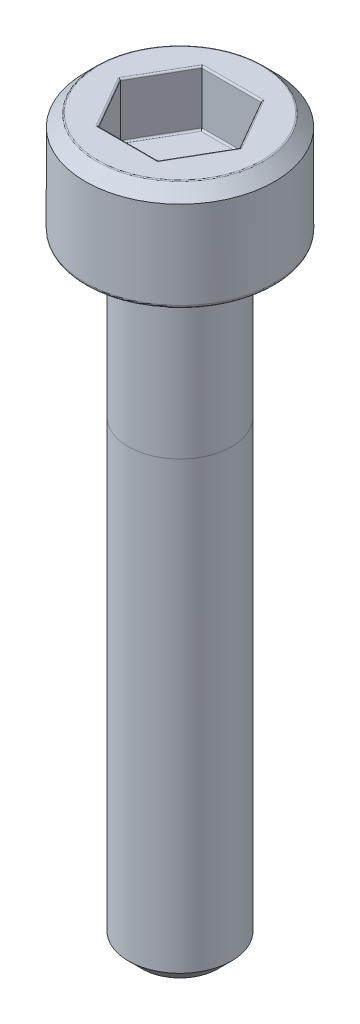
ISO-10303-21;
HEADER;
FILE_DESCRIPTION(('STEP AP214'),'2;1');
FILE_NAME('part.step','',(''),(''),'','','');
FILE_SCHEMA(('AUTOMOTIVE_DESIGN { 1 0 10303 214 1 1 1 1 }'));
ENDSEC;
DATA;
#1=APPLICATION_CONTEXT('core data for automotive mechanical design processes');
#2=APPLICATION_PROTOCOL_DEFINITION('international standard','automotive_design',2000,#1);
#3=PRODUCT_CONTEXT('',#1,'mechanical');
#4=PRODUCT('Part','Part','',(#3));
#5=PRODUCT_RELATED_PRODUCT_CATEGORY('part','',(#4));
#6=PRODUCT_DEFINITION_FORMATION('','',#4);
#7=PRODUCT_DEFINITION_CONTEXT('part definition',#1,'design');
#8=PRODUCT_DEFINITION('design','',#6,#7);
#9=PRODUCT_DEFINITION_SHAPE('','',#8);
#10=(LENGTH_UNIT() NAMED_UNIT(*) SI_UNIT(.MILLI.,.METRE.));
#11=(NAMED_UNIT(*) PLANE_ANGLE_UNIT() SI_UNIT($,.RADIAN.));
#12=(NAMED_UNIT(*) SI_UNIT($,.STERADIAN.) SOLID_ANGLE_UNIT());
#13=UNCERTAINTY_MEASURE_WITH_UNIT(LENGTH_MEASURE(1.E-05),#10,'distance_accuracy_value','');
#14=(GEOMETRIC_REPRESENTATION_CONTEXT(3) GLOBAL_UNCERTAINTY_ASSIGNED_CONTEXT((#13)) GLOBAL_UNIT_ASSIGNED_CONTEXT((#10,
#11,#12)) REPRESENTATION_CONTEXT('',''));
#15=CARTESIAN_POINT('',(0.,0.,0.));
#16=DIRECTION('',(0.,0.,1.));
#17=DIRECTION('',(1.,0.,0.));
#18=AXIS2_PLACEMENT_3D('',#15,#16,#17);
#19=CARTESIAN_POINT('',(0.,71.6279999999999,0.));
#20=DIRECTION('',(0.,1.,0.));
#21=DIRECTION('',(0.,0.,1.));
#22=AXIS2_PLACEMENT_3D('',#19,#20,#21);
#23=CYLINDRICAL_SURFACE('',#22,1.50000000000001);
#24=CARTESIAN_POINT('',(0.,-17.6,0.));
#25=DIRECTION('',(0.,-1.,0.));
#26=DIRECTION('',(0.,0.,-1.));
#27=AXIS2_PLACEMENT_3D('',#24,#25,#26);
#28=CIRCLE('',#27,1.50000000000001);
#29=CARTESIAN_POINT('',(0.,-17.6,-1.50000000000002));
#30=VERTEX_POINT('',#29);
#31=EDGE_CURVE('E294',#30,#30,#28,.F.);
#32=ORIENTED_EDGE('',*,*,#31,.T.);
#33=EDGE_LOOP('',(#32));
#34=FACE_BOUND('',#33,.T.);
#35=CARTESIAN_POINT('',(0.,-4.65,0.));
#36=DIRECTION('',(0.,1.,0.));
#37=DIRECTION('',(0.,0.,1.));
#38=AXIS2_PLACEMENT_3D('',#35,#36,#37);
#39=CIRCLE('',#38,1.50000000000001);
#40=CARTESIAN_POINT('',(0.,-4.65,1.50000000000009));
#41=VERTEX_POINT('',#40);
#42=EDGE_CURVE('E11',#41,#41,#39,.F.);
#43=ORIENTED_EDGE('',*,*,#42,.T.);
#44=EDGE_LOOP('',(#43));
#45=FACE_BOUND('',#44,.T.);
#46=ADVANCED_FACE('F36',(#34,#45),#23,.T.);
#47=CARTESIAN_POINT('',(0.,3.,0.));
#48=DIRECTION('',(0.,1.,0.));
#49=DIRECTION('',(0.,0.,1.));
#50=AXIS2_PLACEMENT_3D('',#47,#48,#49);
#51=PLANE('',#50);
#52=CARTESIAN_POINT('',(0.,3.,0.));
#53=DIRECTION('',(0.,1.,0.));
#54=DIRECTION('',(0.,0.,1.));
#55=AXIS2_PLACEMENT_3D('',#52,#53,#54);
#56=CIRCLE('',#55,2.37928932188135);
#57=CARTESIAN_POINT('',(0.,3.,2.37928932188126));
#58=VERTEX_POINT('',#57);
#59=EDGE_CURVE('E192',#58,#58,#56,.T.);
#60=ORIENTED_EDGE('',*,*,#59,.T.);
#61=EDGE_LOOP('',(#60));
#62=FACE_BOUND('',#61,.T.);
#63=DIRECTION('',(-0.5,0.,-0.866025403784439));
#64=VECTOR('',#63,1.);
#65=CARTESIAN_POINT('',(1.77535207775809,3.,-0.025000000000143));
#66=LINE('',#65,#64);
#67=CARTESIAN_POINT('',(0.894892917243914,3.,-1.55000000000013));
#68=VERTEX_POINT('',#67);
#69=CARTESIAN_POINT('',(1.78978583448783,3.,0.));
#70=VERTEX_POINT('',#69);
#71=EDGE_CURVE('E52',#68,#70,#66,.F.);
#72=ORIENTED_EDGE('',*,*,#71,.T.);
#73=DIRECTION('',(0.5,0.,-0.866025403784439));
#74=VECTOR('',#73,1.);
#75=CARTESIAN_POINT('',(0.909326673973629,3.,1.52499999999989));
#76=LINE('',#75,#74);
#77=CARTESIAN_POINT('',(0.894892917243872,3.,1.54999999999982));
#78=VERTEX_POINT('',#77);
#79=EDGE_CURVE('E190',#70,#78,#76,.F.);
#80=ORIENTED_EDGE('',*,*,#79,.T.);
#81=DIRECTION('',(1.,0.,0.));
#82=VECTOR('',#81,1.);
#83=CARTESIAN_POINT('',(-0.866025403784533,3.,1.54999999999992));
#84=LINE('',#83,#82);
#85=CARTESIAN_POINT('',(-0.894892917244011,3.,1.54999999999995));
#86=VERTEX_POINT('',#85);
#87=EDGE_CURVE('E182',#78,#86,#84,.F.);
#88=ORIENTED_EDGE('',*,*,#87,.T.);
#89=DIRECTION('',(0.5,0.,0.866025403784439));
#90=VECTOR('',#89,1.);
#91=CARTESIAN_POINT('',(-1.77535207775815,3.,0.024999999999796));
#92=LINE('',#91,#90);
#93=CARTESIAN_POINT('',(-1.7897858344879,3.,-2.28983498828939E-13));
#94=VERTEX_POINT('',#93);
#95=EDGE_CURVE('E184',#86,#94,#92,.F.);
#96=ORIENTED_EDGE('',*,*,#95,.T.);
#97=DIRECTION('',(-0.5,0.,0.866025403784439));
#98=VECTOR('',#97,1.);
#99=CARTESIAN_POINT('',(-0.909326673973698,3.,-1.52500000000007));
#100=LINE('',#99,#98);
#101=CARTESIAN_POINT('',(-0.894892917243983,3.,-1.55000000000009));
#102=VERTEX_POINT('',#101);
#103=EDGE_CURVE('E186',#94,#102,#100,.F.);
#104=ORIENTED_EDGE('',*,*,#103,.T.);
#105=DIRECTION('',(-1.,0.,0.));
#106=VECTOR('',#105,1.);
#107=CARTESIAN_POINT('',(0.866025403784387,3.,-1.55000000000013));
#108=LINE('',#107,#106);
#109=EDGE_CURVE('E57',#102,#68,#108,.F.);
#110=ORIENTED_EDGE('',*,*,#109,.T.);
#111=EDGE_LOOP('',(#72,#80,#88,#96,#104,#110));
#112=FACE_BOUND('',#111,.T.);
#113=ADVANCED_FACE('F38',(#62,#112),#51,.T.);
#114=CARTESIAN_POINT('',(0.,71.6279999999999,0.));
#115=DIRECTION('',(0.,1.,0.));
#116=DIRECTION('',(0.,0.,1.));
#117=AXIS2_PLACEMENT_3D('',#114,#115,#116);
#118=CYLINDRICAL_SURFACE('',#117,2.75000000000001);
#119=CARTESIAN_POINT('',(0.,0.100000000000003,0.));
#120=DIRECTION('',(0.,-1.,0.));
#121=DIRECTION('',(0.,0.,-1.));
#122=AXIS2_PLACEMENT_3D('',#119,#120,#121);
#123=CIRCLE('',#122,2.75000000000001);
#124=CARTESIAN_POINT('',(0.,0.100000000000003,-2.74999999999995));
#125=VERTEX_POINT('',#124);
#126=EDGE_CURVE('E147',#125,#125,#123,.F.);
#127=ORIENTED_EDGE('',*,*,#126,.T.);
#128=EDGE_LOOP('',(#127));
#129=FACE_BOUND('',#128,.T.);
#130=CARTESIAN_POINT('',(0.,2.65,0.));
#131=DIRECTION('',(0.,1.,0.));
#132=DIRECTION('',(0.,0.,1.));
#133=AXIS2_PLACEMENT_3D('',#130,#131,#132);
#134=CIRCLE('',#133,2.75000000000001);
#135=CARTESIAN_POINT('',(0.,2.65,2.74999999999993));
#136=VERTEX_POINT('',#135);
#137=EDGE_CURVE('E277',#136,#136,#134,.F.);
#138=ORIENTED_EDGE('',*,*,#137,.T.);
#139=EDGE_LOOP('',(#138));
#140=FACE_BOUND('',#139,.T.);
#141=ADVANCED_FACE('F208',(#129,#140),#118,.T.);
#142=CARTESIAN_POINT('',(2.75,0.,0.));
#143=DIRECTION('',(0.,-1.,0.));
#144=DIRECTION('',(0.,0.,-1.));
#145=AXIS2_PLACEMENT_3D('',#142,#143,#144);
#146=PLANE('',#145);
#147=CARTESIAN_POINT('',(0.,0.,0.));
#148=DIRECTION('',(0.,-1.,0.));
#149=DIRECTION('',(0.,0.,-1.));
#150=AXIS2_PLACEMENT_3D('',#147,#148,#149);
#151=CIRCLE('',#150,1.60000000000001);
#152=CARTESIAN_POINT('',(0.,0.,-1.59999999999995));
#153=VERTEX_POINT('',#152);
#154=EDGE_CURVE('E239',#153,#153,#151,.F.);
#155=ORIENTED_EDGE('',*,*,#154,.T.);
#156=EDGE_LOOP('',(#155));
#157=FACE_BOUND('',#156,.T.);
#158=CARTESIAN_POINT('',(0.,0.,0.));
#159=DIRECTION('',(0.,-1.,0.));
#160=DIRECTION('',(0.,0.,-1.));
#161=AXIS2_PLACEMENT_3D('',#158,#159,#160);
#162=CIRCLE('',#161,2.65000000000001);
#163=CARTESIAN_POINT('',(0.,0.,-2.64999999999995));
#164=VERTEX_POINT('',#163);
#165=EDGE_CURVE('E244',#164,#164,#162,.T.);
#166=ORIENTED_EDGE('',*,*,#165,.T.);
#167=EDGE_LOOP('',(#166));
#168=FACE_BOUND('',#167,.T.);
#169=ADVANCED_FACE('F213',(#157,#168),#146,.T.);
#170=ORIENTED_EDGE('',*,*,#42,.F.);
#171=EDGE_LOOP('',(#170));
#172=FACE_BOUND('',#171,.T.);
#173=CARTESIAN_POINT('',(0.,-0.100000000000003,0.));
#174=DIRECTION('',(0.,-1.,0.));
#175=DIRECTION('',(0.,0.,-1.));
#176=AXIS2_PLACEMENT_3D('',#173,#174,#175);
#177=CIRCLE('',#176,1.50000000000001);
#178=CARTESIAN_POINT('',(0.,-0.100000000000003,-1.49999999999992));
#179=VERTEX_POINT('',#178);
#180=EDGE_CURVE('E237',#179,#179,#177,.T.);
#181=ORIENTED_EDGE('',*,*,#180,.T.);
#182=EDGE_LOOP('',(#181));
#183=FACE_BOUND('',#182,.T.);
#184=ADVANCED_FACE('F217',(#172,#183),#23,.T.);
#185=CARTESIAN_POINT('',(1.50000000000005,-18.,0.));
#186=DIRECTION('',(0.,-1.,0.));
#187=DIRECTION('',(0.,0.,-1.));
#188=AXIS2_PLACEMENT_3D('',#185,#186,#187);
#189=PLANE('',#188);
#190=CARTESIAN_POINT('',(0.,-18.,0.));
#191=DIRECTION('',(0.,-1.,0.));
#192=DIRECTION('',(0.,0.,-1.));
#193=AXIS2_PLACEMENT_3D('',#190,#191,#192);
#194=CIRCLE('',#193,1.10000000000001);
#195=CARTESIAN_POINT('',(0.,-18.,-1.10000000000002));
#196=VERTEX_POINT('',#195);
#197=EDGE_CURVE('E296',#196,#196,#194,.T.);
#198=ORIENTED_EDGE('',*,*,#197,.T.);
#199=EDGE_LOOP('',(#198));
#200=FACE_BOUND('',#199,.T.);
#201=ADVANCED_FACE('F225',(#200),#189,.T.);
#202=CARTESIAN_POINT('',(0.,3.,0.));
#203=DIRECTION('',(0.,-1.,0.));
#204=DIRECTION('',(0.,0.,-1.));
#205=AXIS2_PLACEMENT_3D('',#202,#203,#204);
#206=CONICAL_SURFACE('',#205,2.4,0.785398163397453);
#207=CARTESIAN_POINT('',(0.,2.98535533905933,0.));
#208=DIRECTION('',(0.,1.,0.));
#209=DIRECTION('',(0.,0.,1.));
#210=AXIS2_PLACEMENT_3D('',#207,#208,#209);
#211=CIRCLE('',#210,2.41464466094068);
#212=CARTESIAN_POINT('',(0.,2.98535533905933,2.41464466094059));
#213=VERTEX_POINT('',#212);
#214=EDGE_CURVE('E45',#213,#213,#211,.F.);
#215=ORIENTED_EDGE('',*,*,#214,.T.);
#216=EDGE_LOOP('',(#215));
#217=FACE_BOUND('',#216,.T.);
#218=ORIENTED_EDGE('',*,*,#137,.F.);
#219=EDGE_LOOP('',(#218));
#220=FACE_BOUND('',#219,.T.);
#221=ADVANCED_FACE('F197',(#217,#220),#206,.T.);
#222=CARTESIAN_POINT('',(0.,-17.6,0.));
#223=DIRECTION('',(0.,1.,0.));
#224=DIRECTION('',(0.,0.,1.));
#225=AXIS2_PLACEMENT_3D('',#222,#223,#224);
#226=CONICAL_SURFACE('',#225,1.50000000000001,0.785398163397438);
#227=ORIENTED_EDGE('',*,*,#197,.F.);
#228=EDGE_LOOP('',(#227));
#229=FACE_BOUND('',#228,.T.);
#230=ORIENTED_EDGE('',*,*,#31,.F.);
#231=EDGE_LOOP('',(#230));
#232=FACE_BOUND('',#231,.T.);
#233=ADVANCED_FACE('F312',(#229,#232),#226,.T.);
#234=CARTESIAN_POINT('',(0.,-0.100000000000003,0.));
#235=DIRECTION('',(0.,-1.,0.));
#236=DIRECTION('',(0.,0.,-1.));
#237=AXIS2_PLACEMENT_3D('',#234,#235,#236);
#238=TOROIDAL_SURFACE('',#237,1.60000000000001,0.1);
#239=ORIENTED_EDGE('',*,*,#180,.F.);
#240=EDGE_LOOP('',(#239));
#241=FACE_BOUND('',#240,.T.);
#242=ORIENTED_EDGE('',*,*,#154,.F.);
#243=EDGE_LOOP('',(#242));
#244=FACE_BOUND('',#243,.T.);
#245=ADVANCED_FACE('F306',(#241,#244),#238,.F.);
#246=CARTESIAN_POINT('',(0.,0.100000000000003,0.));
#247=DIRECTION('',(0.,-1.,0.));
#248=DIRECTION('',(0.,0.,-1.));
#249=AXIS2_PLACEMENT_3D('',#246,#247,#248);
#250=TOROIDAL_SURFACE('',#249,2.65000000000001,0.1);
#251=ORIENTED_EDGE('',*,*,#165,.F.);
#252=EDGE_LOOP('',(#251));
#253=FACE_BOUND('',#252,.T.);
#254=ORIENTED_EDGE('',*,*,#126,.F.);
#255=EDGE_LOOP('',(#254));
#256=FACE_BOUND('',#255,.T.);
#257=ADVANCED_FACE('F302',(#253,#256),#250,.T.);
#258=CARTESIAN_POINT('',(-0.866025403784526,1.4,1.49999999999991));
#259=DIRECTION('',(0.,0.,1.));
#260=DIRECTION('',(1.,0.,0.));
#261=AXIS2_PLACEMENT_3D('',#258,#259,#260);
#262=PLANE('',#261);
#263=DIRECTION('',(0.,1.,0.));
#264=VECTOR('',#263,1.);
#265=CARTESIAN_POINT('',(0.866025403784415,1.4,1.49999999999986));
#266=LINE('',#265,#264);
#267=CARTESIAN_POINT('',(0.866025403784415,1.45,1.49999999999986));
#268=VERTEX_POINT('',#267);
#269=CARTESIAN_POINT('',(0.86602540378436,2.95,1.49999999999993));
#270=VERTEX_POINT('',#269);
#271=EDGE_CURVE('E273',#268,#270,#266,.T.);
#272=ORIENTED_EDGE('',*,*,#271,.F.);
#273=DIRECTION('',(1.,0.,0.));
#274=VECTOR('',#273,1.);
#275=CARTESIAN_POINT('',(-0.866025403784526,1.45,1.49999999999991));
#276=LINE('',#275,#274);
#277=CARTESIAN_POINT('',(-0.866025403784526,1.45,1.49999999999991));
#278=VERTEX_POINT('',#277);
#279=EDGE_CURVE('E180',#268,#278,#276,.F.);
#280=ORIENTED_EDGE('',*,*,#279,.T.);
#281=DIRECTION('',(0.,1.,0.));
#282=VECTOR('',#281,1.);
#283=CARTESIAN_POINT('',(-0.866025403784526,1.4,1.49999999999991));
#284=LINE('',#283,#282);
#285=CARTESIAN_POINT('',(-0.866025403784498,2.95,1.49999999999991));
#286=VERTEX_POINT('',#285);
#287=EDGE_CURVE('E274',#278,#286,#284,.T.);
#288=ORIENTED_EDGE('',*,*,#287,.T.);
#289=DIRECTION('',(1.,0.,0.));
#290=VECTOR('',#289,1.);
#291=CARTESIAN_POINT('',(0.86602540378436,2.95,1.49999999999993));
#292=LINE('',#291,#290);
#293=EDGE_CURVE('E178',#286,#270,#292,.T.);
#294=ORIENTED_EDGE('',*,*,#293,.T.);
#295=EDGE_LOOP('',(#272,#280,#288,#294));
#296=FACE_BOUND('',#295,.T.);
#297=ADVANCED_FACE('F305',(#296),#262,.F.);
#298=CARTESIAN_POINT('',(-1.73205080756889,1.4,-2.08166817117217E-13));
#299=DIRECTION('',(-0.866025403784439,0.,0.5));
#300=DIRECTION('',(0.5,0.,0.866025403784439));
#301=AXIS2_PLACEMENT_3D('',#298,#299,#300);
#302=PLANE('',#301);
#303=ORIENTED_EDGE('',*,*,#287,.F.);
#304=DIRECTION('',(0.5,0.,0.866025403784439));
#305=VECTOR('',#304,1.);
#306=CARTESIAN_POINT('',(-1.73205080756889,1.45,-2.08166817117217E-13));
#307=LINE('',#306,#305);
#308=CARTESIAN_POINT('',(-1.73205080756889,1.45,-2.08166817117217E-13));
#309=VERTEX_POINT('',#308);
#310=EDGE_CURVE('E133',#278,#309,#307,.F.);
#311=ORIENTED_EDGE('',*,*,#310,.T.);
#312=DIRECTION('',(0.,1.,0.));
#313=VECTOR('',#312,1.);
#314=CARTESIAN_POINT('',(-1.73205080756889,1.4,-2.08166817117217E-13));
#315=LINE('',#314,#313);
#316=CARTESIAN_POINT('',(-1.73205080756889,2.95,-2.35922392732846E-13));
#317=VERTEX_POINT('',#316);
#318=EDGE_CURVE('E278',#309,#317,#315,.T.);
#319=ORIENTED_EDGE('',*,*,#318,.T.);
#320=DIRECTION('',(0.5,0.,0.866025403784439));
#321=VECTOR('',#320,1.);
#322=CARTESIAN_POINT('',(-0.866025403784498,2.95,1.49999999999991));
#323=LINE('',#322,#321);
#324=EDGE_CURVE('E153',#317,#286,#323,.T.);
#325=ORIENTED_EDGE('',*,*,#324,.T.);
#326=EDGE_LOOP('',(#303,#311,#319,#325));
#327=FACE_BOUND('',#326,.T.);
#328=ADVANCED_FACE('F324',(#327),#302,.F.);
#329=CARTESIAN_POINT('',(-0.866025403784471,1.4,-1.50000000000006));
#330=DIRECTION('',(-0.866025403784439,0.,-0.5));
#331=DIRECTION('',(-0.5,0.,0.866025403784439));
#332=AXIS2_PLACEMENT_3D('',#329,#330,#331);
#333=PLANE('',#332);
#334=ORIENTED_EDGE('',*,*,#318,.F.);
#335=DIRECTION('',(-0.5,0.,0.866025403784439));
#336=VECTOR('',#335,1.);
#337=CARTESIAN_POINT('',(-0.866025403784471,1.45,-1.50000000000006));
#338=LINE('',#337,#336);
#339=CARTESIAN_POINT('',(-0.866025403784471,1.45,-1.50000000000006));
#340=VERTEX_POINT('',#339);
#341=EDGE_CURVE('E163',#309,#340,#338,.F.);
#342=ORIENTED_EDGE('',*,*,#341,.T.);
#343=DIRECTION('',(0.,1.,0.));
#344=VECTOR('',#343,1.);
#345=CARTESIAN_POINT('',(-0.866025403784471,1.4,-1.50000000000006));
#346=LINE('',#345,#344);
#347=CARTESIAN_POINT('',(-0.866025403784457,2.95,-1.50000000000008));
#348=VERTEX_POINT('',#347);
#349=EDGE_CURVE('E281',#340,#348,#346,.T.);
#350=ORIENTED_EDGE('',*,*,#349,.T.);
#351=DIRECTION('',(-0.5,0.,0.866025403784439));
#352=VECTOR('',#351,1.);
#353=CARTESIAN_POINT('',(-1.73205080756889,2.95,-2.35922392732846E-13));
#354=LINE('',#353,#352);
#355=EDGE_CURVE('E161',#348,#317,#354,.T.);
#356=ORIENTED_EDGE('',*,*,#355,.T.);
#357=EDGE_LOOP('',(#334,#342,#350,#356));
#358=FACE_BOUND('',#357,.T.);
#359=ADVANCED_FACE('F337',(#358),#333,.F.);
#360=CARTESIAN_POINT('',(0.866025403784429,1.4,-1.50000000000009));
#361=DIRECTION('',(0.,0.,-1.));
#362=DIRECTION('',(-1.,0.,0.));
#363=AXIS2_PLACEMENT_3D('',#360,#361,#362);
#364=PLANE('',#363);
#365=ORIENTED_EDGE('',*,*,#349,.F.);
#366=DIRECTION('',(-1.,0.,0.));
#367=VECTOR('',#366,1.);
#368=CARTESIAN_POINT('',(0.866025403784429,1.45,-1.50000000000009));
#369=LINE('',#368,#367);
#370=CARTESIAN_POINT('',(0.866025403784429,1.45,-1.50000000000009));
#371=VERTEX_POINT('',#370);
#372=EDGE_CURVE('E167',#340,#371,#369,.F.);
#373=ORIENTED_EDGE('',*,*,#372,.T.);
#374=DIRECTION('',(0.,1.,0.));
#375=VECTOR('',#374,1.);
#376=CARTESIAN_POINT('',(0.866025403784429,1.4,-1.50000000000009));
#377=LINE('',#376,#375);
#378=CARTESIAN_POINT('',(0.866025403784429,2.95,-1.50000000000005));
#379=VERTEX_POINT('',#378);
#380=EDGE_CURVE('E284',#371,#379,#377,.T.);
#381=ORIENTED_EDGE('',*,*,#380,.T.);
#382=DIRECTION('',(-1.,0.,0.));
#383=VECTOR('',#382,1.);
#384=CARTESIAN_POINT('',(-0.866025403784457,2.95,-1.50000000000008));
#385=LINE('',#384,#383);
#386=EDGE_CURVE('E165',#379,#348,#385,.T.);
#387=ORIENTED_EDGE('',*,*,#386,.T.);
#388=EDGE_LOOP('',(#365,#373,#381,#387));
#389=FACE_BOUND('',#388,.T.);
#390=ADVANCED_FACE('F333',(#389),#364,.F.);
#391=CARTESIAN_POINT('',(1.73205080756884,1.4,0.));
#392=DIRECTION('',(0.866025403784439,0.,-0.5));
#393=DIRECTION('',(-0.5,0.,-0.866025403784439));
#394=AXIS2_PLACEMENT_3D('',#391,#392,#393);
#395=PLANE('',#394);
#396=ORIENTED_EDGE('',*,*,#380,.F.);
#397=DIRECTION('',(-0.5,0.,-0.866025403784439));
#398=VECTOR('',#397,1.);
#399=CARTESIAN_POINT('',(1.73205080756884,1.45,0.));
#400=LINE('',#399,#398);
#401=CARTESIAN_POINT('',(1.73205080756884,1.45,0.));
#402=VERTEX_POINT('',#401);
#403=EDGE_CURVE('E171',#371,#402,#400,.F.);
#404=ORIENTED_EDGE('',*,*,#403,.T.);
#405=DIRECTION('',(0.,1.,0.));
#406=VECTOR('',#405,1.);
#407=CARTESIAN_POINT('',(1.73205080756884,1.4,0.));
#408=LINE('',#407,#406);
#409=CARTESIAN_POINT('',(1.73205080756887,2.95,-1.11022302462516E-13));
#410=VERTEX_POINT('',#409);
#411=EDGE_CURVE('E287',#402,#410,#408,.T.);
#412=ORIENTED_EDGE('',*,*,#411,.T.);
#413=DIRECTION('',(-0.5,0.,-0.866025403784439));
#414=VECTOR('',#413,1.);
#415=CARTESIAN_POINT('',(0.866025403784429,2.95,-1.50000000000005));
#416=LINE('',#415,#414);
#417=EDGE_CURVE('E169',#410,#379,#416,.T.);
#418=ORIENTED_EDGE('',*,*,#417,.T.);
#419=EDGE_LOOP('',(#396,#404,#412,#418));
#420=FACE_BOUND('',#419,.T.);
#421=ADVANCED_FACE('F329',(#420),#395,.F.);
#422=CARTESIAN_POINT('',(0.866025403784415,1.4,1.49999999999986));
#423=DIRECTION('',(0.866025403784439,0.,0.5));
#424=DIRECTION('',(0.5,0.,-0.866025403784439));
#425=AXIS2_PLACEMENT_3D('',#422,#423,#424);
#426=PLANE('',#425);
#427=ORIENTED_EDGE('',*,*,#411,.F.);
#428=DIRECTION('',(0.5,0.,-0.866025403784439));
#429=VECTOR('',#428,1.);
#430=CARTESIAN_POINT('',(0.866025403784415,1.45,1.49999999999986));
#431=LINE('',#430,#429);
#432=EDGE_CURVE('E176',#402,#268,#431,.F.);
#433=ORIENTED_EDGE('',*,*,#432,.T.);
#434=ORIENTED_EDGE('',*,*,#271,.T.);
#435=DIRECTION('',(0.5,0.,-0.866025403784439));
#436=VECTOR('',#435,1.);
#437=CARTESIAN_POINT('',(1.73205080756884,2.95,-1.17961196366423E-13));
#438=LINE('',#437,#436);
#439=EDGE_CURVE('E173',#270,#410,#438,.T.);
#440=ORIENTED_EDGE('',*,*,#439,.T.);
#441=EDGE_LOOP('',(#427,#433,#434,#440));
#442=FACE_BOUND('',#441,.T.);
#443=ADVANCED_FACE('F326',(#442),#426,.F.);
#444=CARTESIAN_POINT('',(2.59807621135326,1.4,1.49999999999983));
#445=DIRECTION('',(0.,1.,0.));
#446=DIRECTION('',(0.,0.,1.));
#447=AXIS2_PLACEMENT_3D('',#444,#445,#446);
#448=PLANE('',#447);
#449=DIRECTION('',(-0.5,0.,0.866025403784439));
#450=VECTOR('',#449,1.);
#451=CARTESIAN_POINT('',(-1.25573683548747,1.4,-0.725000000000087));
#452=LINE('',#451,#450);
#453=CARTESIAN_POINT('',(-0.837157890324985,1.4,-1.45000000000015));
#454=VERTEX_POINT('',#453);
#455=CARTESIAN_POINT('',(-1.67431578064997,1.4,-2.63677968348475E-13));
#456=VERTEX_POINT('',#455);
#457=EDGE_CURVE('E151',#454,#456,#452,.T.);
#458=ORIENTED_EDGE('',*,*,#457,.T.);
#459=DIRECTION('',(0.5,0.,0.866025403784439));
#460=VECTOR('',#459,1.);
#461=CARTESIAN_POINT('',(0.0433012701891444,1.4,2.97499999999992));
#462=LINE('',#461,#460);
#463=CARTESIAN_POINT('',(-0.837157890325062,1.4,1.44999999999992));
#464=VERTEX_POINT('',#463);
#465=EDGE_CURVE('E131',#456,#464,#462,.T.);
#466=ORIENTED_EDGE('',*,*,#465,.T.);
#467=DIRECTION('',(1.,0.,0.));
#468=VECTOR('',#467,1.);
#469=CARTESIAN_POINT('',(2.59807621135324,1.4,1.44999999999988));
#470=LINE('',#469,#468);
#471=CARTESIAN_POINT('',(0.837157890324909,1.4,1.44999999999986));
#472=VERTEX_POINT('',#471);
#473=EDGE_CURVE('E140',#464,#472,#470,.T.);
#474=ORIENTED_EDGE('',*,*,#473,.T.);
#475=DIRECTION('',(0.5,0.,-0.866025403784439));
#476=VECTOR('',#475,1.);
#477=CARTESIAN_POINT('',(1.2557368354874,1.4,0.724999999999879));
#478=LINE('',#477,#476);
#479=CARTESIAN_POINT('',(1.67431578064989,1.4,-1.17961196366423E-13));
#480=VERTEX_POINT('',#479);
#481=EDGE_CURVE('E146',#472,#480,#478,.T.);
#482=ORIENTED_EDGE('',*,*,#481,.T.);
#483=DIRECTION('',(-0.5,0.,-0.866025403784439));
#484=VECTOR('',#483,1.);
#485=CARTESIAN_POINT('',(2.55477494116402,1.4,1.52499999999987));
#486=LINE('',#485,#484);
#487=CARTESIAN_POINT('',(0.83715789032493,1.4,-1.45000000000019));
#488=VERTEX_POINT('',#487);
#489=EDGE_CURVE('E249',#480,#488,#486,.T.);
#490=ORIENTED_EDGE('',*,*,#489,.T.);
#491=DIRECTION('',(-1.,0.,0.));
#492=VECTOR('',#491,1.);
#493=CARTESIAN_POINT('',(2.59807621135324,1.4,-1.45000000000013));
#494=LINE('',#493,#492);
#495=EDGE_CURVE('E156',#488,#454,#494,.T.);
#496=ORIENTED_EDGE('',*,*,#495,.T.);
#497=EDGE_LOOP('',(#458,#466,#474,#482,#490,#496));
#498=FACE_BOUND('',#497,.T.);
#499=ADVANCED_FACE('F149',(#498),#448,.T.);
#500=CARTESIAN_POINT('',(2.55477494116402,1.45,1.52499999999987));
#501=DIRECTION('',(-0.5,0.,-0.866025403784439));
#502=DIRECTION('',(-0.866025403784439,0.,0.5));
#503=AXIS2_PLACEMENT_3D('',#500,#501,#502);
#504=CYLINDRICAL_SURFACE('',#503,0.05);
#505=CARTESIAN_POINT('',(1.67431578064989,1.45,-1.17961196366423E-13));
#506=DIRECTION('',(0.,0.,-1.));
#507=DIRECTION('',(-1.,0.,0.));
#508=AXIS2_PLACEMENT_3D('',#505,#506,#507);
#509=ELLIPSE('',#508,0.0577350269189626,0.05);
#510=EDGE_CURVE('E262',#402,#480,#509,.T.);
#511=ORIENTED_EDGE('',*,*,#510,.F.);
#512=ORIENTED_EDGE('',*,*,#403,.F.);
#513=CARTESIAN_POINT('',(0.83715789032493,1.45,-1.45000000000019));
#514=DIRECTION('',(-0.866025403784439,0.,-0.5));
#515=DIRECTION('',(-0.5,0.,0.866025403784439));
#516=AXIS2_PLACEMENT_3D('',#513,#514,#515);
#517=ELLIPSE('',#516,0.0577350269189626,0.05);
#518=EDGE_CURVE('E271',#488,#371,#517,.F.);
#519=ORIENTED_EDGE('',*,*,#518,.F.);
#520=ORIENTED_EDGE('',*,*,#489,.F.);
#521=EDGE_LOOP('',(#511,#512,#519,#520));
#522=FACE_BOUND('',#521,.T.);
#523=ADVANCED_FACE('F347',(#522),#504,.F.);
#524=CARTESIAN_POINT('',(2.59807621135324,1.45,-1.45000000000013));
#525=DIRECTION('',(-1.,0.,0.));
#526=DIRECTION('',(0.,0.,1.));
#527=AXIS2_PLACEMENT_3D('',#524,#525,#526);
#528=CYLINDRICAL_SURFACE('',#527,0.05);
#529=ORIENTED_EDGE('',*,*,#518,.T.);
#530=ORIENTED_EDGE('',*,*,#372,.F.);
#531=CARTESIAN_POINT('',(-0.837157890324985,1.45,-1.45000000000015));
#532=DIRECTION('',(-0.866025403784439,0.,0.5));
#533=DIRECTION('',(0.5,0.,0.866025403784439));
#534=AXIS2_PLACEMENT_3D('',#531,#532,#533);
#535=ELLIPSE('',#534,0.0577350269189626,0.05);
#536=EDGE_CURVE('E258',#454,#340,#535,.F.);
#537=ORIENTED_EDGE('',*,*,#536,.F.);
#538=ORIENTED_EDGE('',*,*,#495,.F.);
#539=EDGE_LOOP('',(#529,#530,#537,#538));
#540=FACE_BOUND('',#539,.T.);
#541=ADVANCED_FACE('F259',(#540),#528,.F.);
#542=CARTESIAN_POINT('',(1.2557368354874,1.45,0.724999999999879));
#543=DIRECTION('',(0.5,0.,-0.866025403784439));
#544=DIRECTION('',(-0.866025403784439,0.,-0.5));
#545=AXIS2_PLACEMENT_3D('',#542,#543,#544);
#546=CYLINDRICAL_SURFACE('',#545,0.05);
#547=ORIENTED_EDGE('',*,*,#510,.T.);
#548=ORIENTED_EDGE('',*,*,#481,.F.);
#549=CARTESIAN_POINT('',(0.837157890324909,1.45,1.44999999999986));
#550=DIRECTION('',(0.866025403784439,0.,-0.5));
#551=DIRECTION('',(-0.5,0.,-0.866025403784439));
#552=AXIS2_PLACEMENT_3D('',#549,#550,#551);
#553=ELLIPSE('',#552,0.0577350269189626,0.05);
#554=EDGE_CURVE('E143',#268,#472,#553,.T.);
#555=ORIENTED_EDGE('',*,*,#554,.F.);
#556=ORIENTED_EDGE('',*,*,#432,.F.);
#557=EDGE_LOOP('',(#547,#548,#555,#556));
#558=FACE_BOUND('',#557,.T.);
#559=ADVANCED_FACE('F353',(#558),#546,.F.);
#560=CARTESIAN_POINT('',(-1.25573683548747,1.45,-0.725000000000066));
#561=DIRECTION('',(-0.5,0.,0.866025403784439));
#562=DIRECTION('',(0.866025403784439,0.,0.5));
#563=AXIS2_PLACEMENT_3D('',#560,#561,#562);
#564=CYLINDRICAL_SURFACE('',#563,0.05);
#565=ORIENTED_EDGE('',*,*,#536,.T.);
#566=ORIENTED_EDGE('',*,*,#341,.F.);
#567=CARTESIAN_POINT('',(-1.67431578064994,1.45,-2.28983498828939E-13));
#568=DIRECTION('',(0.,0.,1.));
#569=DIRECTION('',(1.,0.,0.));
#570=AXIS2_PLACEMENT_3D('',#567,#568,#569);
#571=ELLIPSE('',#570,0.0577350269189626,0.05);
#572=EDGE_CURVE('E136',#456,#309,#571,.F.);
#573=ORIENTED_EDGE('',*,*,#572,.F.);
#574=ORIENTED_EDGE('',*,*,#457,.F.);
#575=EDGE_LOOP('',(#565,#566,#573,#574));
#576=FACE_BOUND('',#575,.T.);
#577=ADVANCED_FACE('F264',(#576),#564,.F.);
#578=CARTESIAN_POINT('',(2.59807621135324,1.45,1.44999999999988));
#579=DIRECTION('',(1.,0.,0.));
#580=DIRECTION('',(0.,0.,-1.));
#581=AXIS2_PLACEMENT_3D('',#578,#579,#580);
#582=CYLINDRICAL_SURFACE('',#581,0.05);
#583=ORIENTED_EDGE('',*,*,#554,.T.);
#584=ORIENTED_EDGE('',*,*,#473,.F.);
#585=CARTESIAN_POINT('',(-0.837157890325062,1.45,1.44999999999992));
#586=DIRECTION('',(0.866025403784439,0.,0.5));
#587=DIRECTION('',(-0.5,0.,0.866025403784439));
#588=AXIS2_PLACEMENT_3D('',#585,#586,#587);
#589=ELLIPSE('',#588,0.0577350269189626,0.05);
#590=EDGE_CURVE('E127',#278,#464,#589,.T.);
#591=ORIENTED_EDGE('',*,*,#590,.F.);
#592=ORIENTED_EDGE('',*,*,#279,.F.);
#593=EDGE_LOOP('',(#583,#584,#591,#592));
#594=FACE_BOUND('',#593,.T.);
#595=ADVANCED_FACE('F141',(#594),#582,.F.);
#596=CARTESIAN_POINT('',(0.0433012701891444,1.45,2.97499999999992));
#597=DIRECTION('',(0.5,0.,0.866025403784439));
#598=DIRECTION('',(0.866025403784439,0.,-0.5));
#599=AXIS2_PLACEMENT_3D('',#596,#597,#598);
#600=CYLINDRICAL_SURFACE('',#599,0.05);
#601=ORIENTED_EDGE('',*,*,#572,.T.);
#602=ORIENTED_EDGE('',*,*,#310,.F.);
#603=ORIENTED_EDGE('',*,*,#590,.T.);
#604=ORIENTED_EDGE('',*,*,#465,.F.);
#605=EDGE_LOOP('',(#601,#602,#603,#604));
#606=FACE_BOUND('',#605,.T.);
#607=ADVANCED_FACE('F129',(#606),#600,.F.);
#608=CARTESIAN_POINT('',(0.,2.95,0.));
#609=DIRECTION('',(0.,1.,0.));
#610=DIRECTION('',(0.,0.,1.));
#611=AXIS2_PLACEMENT_3D('',#608,#609,#610);
#612=TOROIDAL_SURFACE('',#611,2.37928932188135,0.05);
#613=ORIENTED_EDGE('',*,*,#214,.F.);
#614=EDGE_LOOP('',(#613));
#615=FACE_BOUND('',#614,.T.);
#616=ORIENTED_EDGE('',*,*,#59,.F.);
#617=EDGE_LOOP('',(#616));
#618=FACE_BOUND('',#617,.T.);
#619=ADVANCED_FACE('F200',(#615,#618),#612,.T.);
#620=CARTESIAN_POINT('',(-0.909326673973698,2.95,-1.52500000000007));
#621=DIRECTION('',(0.5,0.,-0.866025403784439));
#622=DIRECTION('',(-0.866025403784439,0.,-0.5));
#623=AXIS2_PLACEMENT_3D('',#620,#621,#622);
#624=CYLINDRICAL_SURFACE('',#623,0.05);
#625=CARTESIAN_POINT('',(-0.894892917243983,2.95,-1.55000000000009));
#626=DIRECTION('',(0.866025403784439,0.,-0.5));
#627=DIRECTION('',(0.5,0.,0.866025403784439));
#628=AXIS2_PLACEMENT_3D('',#625,#626,#627);
#629=ELLIPSE('',#628,0.0577350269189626,0.05);
#630=EDGE_CURVE('E405',#102,#348,#629,.T.);
#631=ORIENTED_EDGE('',*,*,#630,.F.);
#632=ORIENTED_EDGE('',*,*,#103,.F.);
#633=CARTESIAN_POINT('',(-1.78978583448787,2.95,-2.4980018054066E-13));
#634=DIRECTION('',(0.,0.,-1.));
#635=DIRECTION('',(1.,0.,0.));
#636=AXIS2_PLACEMENT_3D('',#633,#634,#635);
#637=ELLIPSE('',#636,0.0577350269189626,0.05);
#638=EDGE_CURVE('E137',#317,#94,#637,.F.);
#639=ORIENTED_EDGE('',*,*,#638,.F.);
#640=ORIENTED_EDGE('',*,*,#355,.F.);
#641=EDGE_LOOP('',(#631,#632,#639,#640));
#642=FACE_BOUND('',#641,.T.);
#643=ADVANCED_FACE('F203',(#642),#624,.T.);
#644=CARTESIAN_POINT('',(-1.77535207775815,2.95,0.024999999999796));
#645=DIRECTION('',(-0.5,0.,-0.866025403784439));
#646=DIRECTION('',(-0.866025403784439,0.,0.5));
#647=AXIS2_PLACEMENT_3D('',#644,#645,#646);
#648=CYLINDRICAL_SURFACE('',#647,0.05);
#649=ORIENTED_EDGE('',*,*,#638,.T.);
#650=ORIENTED_EDGE('',*,*,#95,.F.);
#651=CARTESIAN_POINT('',(-0.894892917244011,2.95,1.54999999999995));
#652=DIRECTION('',(-0.866025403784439,0.,-0.5));
#653=DIRECTION('',(0.5,0.,-0.866025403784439));
#654=AXIS2_PLACEMENT_3D('',#651,#652,#653);
#655=ELLIPSE('',#654,0.0577350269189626,0.05);
#656=EDGE_CURVE('E398',#286,#86,#655,.F.);
#657=ORIENTED_EDGE('',*,*,#656,.F.);
#658=ORIENTED_EDGE('',*,*,#324,.F.);
#659=EDGE_LOOP('',(#649,#650,#657,#658));
#660=FACE_BOUND('',#659,.T.);
#661=ADVANCED_FACE('F365',(#660),#648,.T.);
#662=CARTESIAN_POINT('',(0.866025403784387,2.95,-1.55000000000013));
#663=DIRECTION('',(1.,0.,0.));
#664=DIRECTION('',(0.,0.,-1.));
#665=AXIS2_PLACEMENT_3D('',#662,#663,#664);
#666=CYLINDRICAL_SURFACE('',#665,0.05);
#667=ORIENTED_EDGE('',*,*,#630,.T.);
#668=ORIENTED_EDGE('',*,*,#386,.F.);
#669=CARTESIAN_POINT('',(0.894892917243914,2.95,-1.55000000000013));
#670=DIRECTION('',(0.866025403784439,0.,0.5));
#671=DIRECTION('',(-0.5,0.,0.866025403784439));
#672=AXIS2_PLACEMENT_3D('',#669,#670,#671);
#673=ELLIPSE('',#672,0.0577350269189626,0.05);
#674=EDGE_CURVE('E393',#68,#379,#673,.T.);
#675=ORIENTED_EDGE('',*,*,#674,.F.);
#676=ORIENTED_EDGE('',*,*,#109,.F.);
#677=EDGE_LOOP('',(#667,#668,#675,#676));
#678=FACE_BOUND('',#677,.T.);
#679=ADVANCED_FACE('F369',(#678),#666,.T.);
#680=CARTESIAN_POINT('',(-0.866025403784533,2.95,1.54999999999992));
#681=DIRECTION('',(-1.,0.,0.));
#682=DIRECTION('',(0.,0.,1.));
#683=AXIS2_PLACEMENT_3D('',#680,#681,#682);
#684=CYLINDRICAL_SURFACE('',#683,0.05);
#685=ORIENTED_EDGE('',*,*,#656,.T.);
#686=ORIENTED_EDGE('',*,*,#87,.F.);
#687=CARTESIAN_POINT('',(0.894892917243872,2.95,1.54999999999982));
#688=DIRECTION('',(-0.866025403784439,0.,0.5));
#689=DIRECTION('',(0.5,0.,0.866025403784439));
#690=AXIS2_PLACEMENT_3D('',#687,#688,#689);
#691=ELLIPSE('',#690,0.0577350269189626,0.05);
#692=EDGE_CURVE('E389',#270,#78,#691,.F.);
#693=ORIENTED_EDGE('',*,*,#692,.F.);
#694=ORIENTED_EDGE('',*,*,#293,.F.);
#695=EDGE_LOOP('',(#685,#686,#693,#694));
#696=FACE_BOUND('',#695,.T.);
#697=ADVANCED_FACE('F373',(#696),#684,.T.);
#698=CARTESIAN_POINT('',(1.77535207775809,2.95,-0.025000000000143));
#699=DIRECTION('',(0.5,0.,0.866025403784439));
#700=DIRECTION('',(0.866025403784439,0.,-0.5));
#701=AXIS2_PLACEMENT_3D('',#698,#699,#700);
#702=CYLINDRICAL_SURFACE('',#701,0.05);
#703=ORIENTED_EDGE('',*,*,#674,.T.);
#704=ORIENTED_EDGE('',*,*,#417,.F.);
#705=CARTESIAN_POINT('',(1.78978583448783,2.95,0.));
#706=DIRECTION('',(0.,0.,1.));
#707=DIRECTION('',(-1.,0.,0.));
#708=AXIS2_PLACEMENT_3D('',#705,#706,#707);
#709=ELLIPSE('',#708,0.0577350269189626,0.05);
#710=EDGE_CURVE('E394',#70,#410,#709,.T.);
#711=ORIENTED_EDGE('',*,*,#710,.F.);
#712=ORIENTED_EDGE('',*,*,#71,.F.);
#713=EDGE_LOOP('',(#703,#704,#711,#712));
#714=FACE_BOUND('',#713,.T.);
#715=ADVANCED_FACE('F377',(#714),#702,.T.);
#716=CARTESIAN_POINT('',(0.909326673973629,2.95,1.52499999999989));
#717=DIRECTION('',(-0.5,0.,0.866025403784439));
#718=DIRECTION('',(0.866025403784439,0.,0.5));
#719=AXIS2_PLACEMENT_3D('',#716,#717,#718);
#720=CYLINDRICAL_SURFACE('',#719,0.05);
#721=ORIENTED_EDGE('',*,*,#692,.T.);
#722=ORIENTED_EDGE('',*,*,#79,.F.);
#723=ORIENTED_EDGE('',*,*,#710,.T.);
#724=ORIENTED_EDGE('',*,*,#439,.F.);
#725=EDGE_LOOP('',(#721,#722,#723,#724));
#726=FACE_BOUND('',#725,.T.);
#727=ADVANCED_FACE('F381',(#726),#720,.T.);
#728=CLOSED_SHELL('',(#46,#113,#141,#169,#184,#201,#221,#233,#245,#257,#297,#328,#359,#390,#421,
#443,#499,#523,#541,#559,#577,#595,#607,#619,#643,#661,#679,#697,#715,#727));
#729=MANIFOLD_SOLID_BREP('B2',#728);
#730=ADVANCED_BREP_SHAPE_REPRESENTATION('',(#18,#729),#14);
#731=SHAPE_DEFINITION_REPRESENTATION(#9,#730);
ENDSEC;
END-ISO-10303-21;
